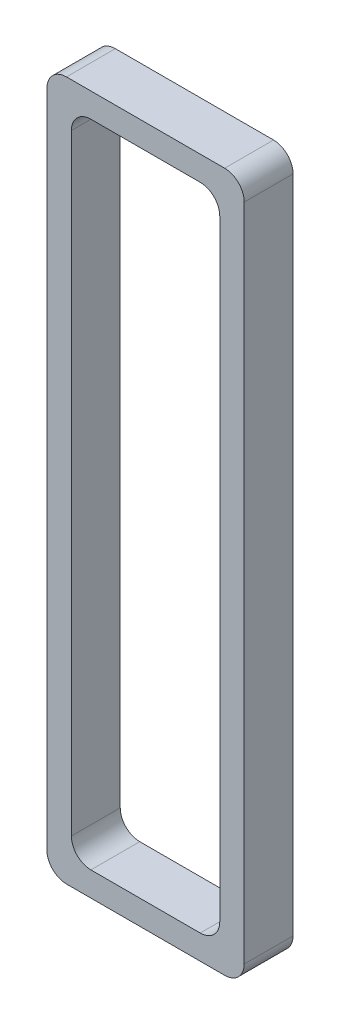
from build123d import *

# Parameters (mm, degrees)
EXTRUDE1_DEPTH = 6.35


with BuildPart() as part:
    # Sketch1 → Extrude1 (new body)
    with BuildSketch(Plane.XY):
        with BuildLine():
            Line((2.54, 14.605), (23.08986048, 14.605))
            ThreePointArc((23.08986048, 14.605), (24.885911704, 13.861051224), (25.62986048, 12.065))
            Line((25.62986048, 12.065), (25.62986048, -73.66))
            ThreePointArc((25.62986048, -73.66), (24.885911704, -75.456051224), (23.08986048, -76.2))
            Line((23.08986048, -76.2), (2.54, -76.2))
            ThreePointArc((2.54, -76.2), (0.743948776, -75.456051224), (0, -73.66))
            Line((0, -73.66), (0, 12.065))
            ThreePointArc((0, 12.065), (0.743948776, 13.861051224), (2.54, 14.605))
        make_face()
        with BuildLine():
            Line((5.715, 11.43), (19.91486048, 11.43))
            ThreePointArc((19.91486048, 11.43), (21.710911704, 10.686051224), (22.45486048, 8.89))
            Line((22.45486048, 8.89), (22.45486048, -70.485))
            ThreePointArc((22.45486048, -70.485), (21.710911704, -72.281051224), (19.91486048, -73.025))
            Line((19.91486048, -73.025), (5.715, -73.025))
            ThreePointArc((5.715, -73.025), (3.918948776, -72.281051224), (3.175, -70.485))
            Line((3.175, -70.485), (3.175, 8.89))
            ThreePointArc((3.175, 8.89), (3.918948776, 10.686051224), (5.715, 11.43))
        make_face(mode=Mode.SUBTRACT)
    extrude(amount=EXTRUDE1_DEPTH)


solid = part.part
